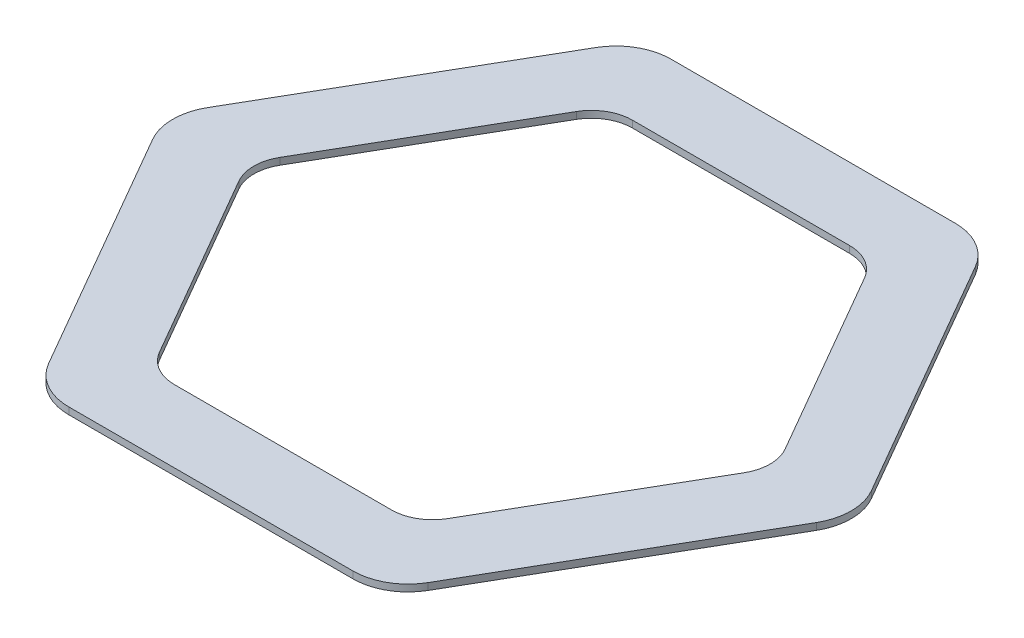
from build123d import *

# Parameters (mm, degrees)
BOSS_EXTRU_1_DEPTH = 2


with BuildPart() as part:
    # Esquisse1 → Boss.-Extru.1 (new body)
    with BuildSketch(Plane(origin=(0, 0, 0), x_dir=(1, 0, 0), z_dir=(0, 1, 0))):
        with BuildLine():
            Line((-55.512228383, 80.05), (-97.081447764, 8.05))
            ThreePointArc((-97.081447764, 8.05), (-99.238438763, 0), (-97.081447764, -8.05))
            Line((-97.081447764, -8.05), (-55.512228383, -80.05))
            ThreePointArc((-55.512228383, -80.05), (-49.619219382, -85.943009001), (-41.569219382, -88.1))
            Line((-41.569219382, -88.1), (41.569219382, -88.1))
            ThreePointArc((41.569219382, -88.1), (49.619219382, -85.943009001), (55.512228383, -80.05))
            Line((55.512228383, -80.05), (97.081447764, -8.05))
            ThreePointArc((97.081447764, -8.05), (99.238438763, 0), (97.081447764, 8.05))
            Line((97.081447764, 8.05), (55.512228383, 80.05))
            ThreePointArc((55.512228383, 80.05), (49.619219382, 85.943009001), (41.569219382, 88.1))
            Line((41.569219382, 88.1), (-41.569219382, 88.1))
            ThreePointArc((-41.569219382, 88.1), (-49.619219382, 85.943009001), (-55.512228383, 80.05))
        make_face()
        with BuildLine():
            Line((-42.146569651, 61), (-73.900834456, 6))
            ThreePointArc((-73.900834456, 6), (-75.508529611, 0), (-73.900834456, -6))
            Line((-73.900834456, -6), (-42.146569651, -61))
            ThreePointArc((-42.146569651, -61), (-37.754264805, -65.392304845), (-31.754264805, -67))
            Line((-31.754264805, -67), (31.754264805, -67))
            ThreePointArc((31.754264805, -67), (37.754264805, -65.392304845), (42.146569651, -61))
            Line((42.146569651, -61), (73.900834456, -6))
            ThreePointArc((73.900834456, -6), (75.508529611, 0), (73.900834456, 6))
            Line((73.900834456, 6), (42.146569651, 61))
            ThreePointArc((42.146569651, 61), (37.754264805, 65.392304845), (31.754264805, 67))
            Line((31.754264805, 67), (-31.754264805, 67))
            ThreePointArc((-31.754264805, 67), (-37.754264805, 65.392304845), (-42.146569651, 61))
        make_face(mode=Mode.SUBTRACT)
    extrude(amount=BOSS_EXTRU_1_DEPTH)


solid = part.part
